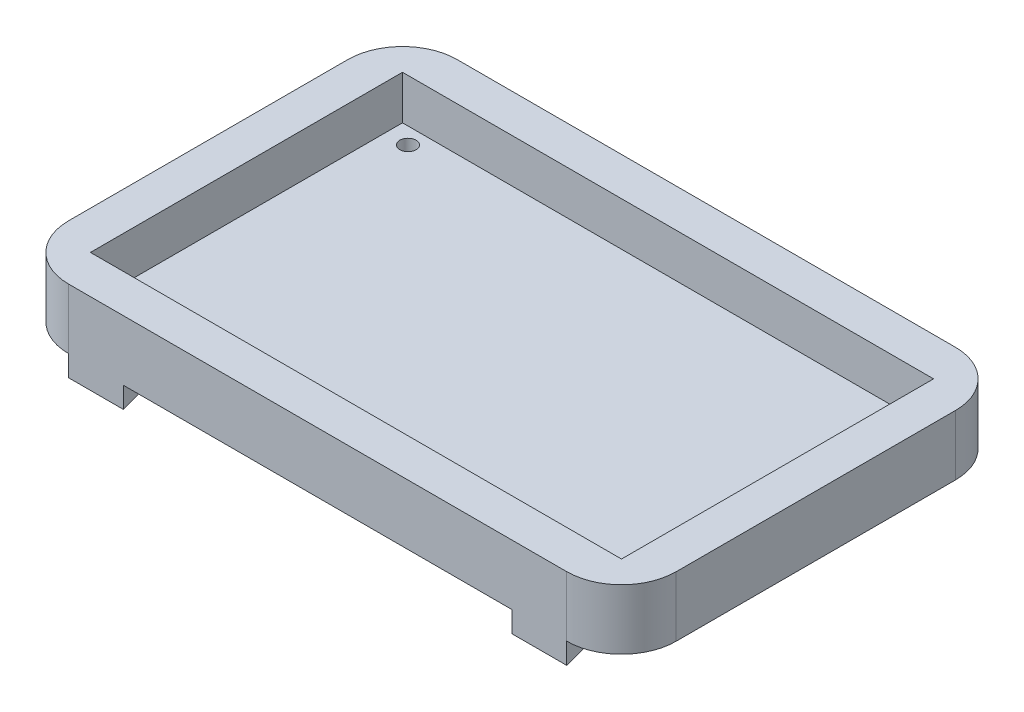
ISO-10303-21;
HEADER;
FILE_DESCRIPTION(('STEP AP214'),'2;1');
FILE_NAME('part.step','',(''),(''),'','','');
FILE_SCHEMA(('AUTOMOTIVE_DESIGN { 1 0 10303 214 1 1 1 1 }'));
ENDSEC;
DATA;
#1=APPLICATION_CONTEXT('core data for automotive mechanical design processes');
#2=APPLICATION_PROTOCOL_DEFINITION('international standard','automotive_design',2000,#1);
#3=PRODUCT_CONTEXT('',#1,'mechanical');
#4=PRODUCT('Part','Part','',(#3));
#5=PRODUCT_RELATED_PRODUCT_CATEGORY('part','',(#4));
#6=PRODUCT_DEFINITION_FORMATION('','',#4);
#7=PRODUCT_DEFINITION_CONTEXT('part definition',#1,'design');
#8=PRODUCT_DEFINITION('design','',#6,#7);
#9=PRODUCT_DEFINITION_SHAPE('','',#8);
#10=(LENGTH_UNIT() NAMED_UNIT(*) SI_UNIT(.MILLI.,.METRE.));
#11=(NAMED_UNIT(*) PLANE_ANGLE_UNIT() SI_UNIT($,.RADIAN.));
#12=(NAMED_UNIT(*) SI_UNIT($,.STERADIAN.) SOLID_ANGLE_UNIT());
#13=UNCERTAINTY_MEASURE_WITH_UNIT(LENGTH_MEASURE(1.E-05),#10,'distance_accuracy_value','');
#14=(GEOMETRIC_REPRESENTATION_CONTEXT(3) GLOBAL_UNCERTAINTY_ASSIGNED_CONTEXT((#13)) GLOBAL_UNIT_ASSIGNED_CONTEXT((#10,
#11,#12)) REPRESENTATION_CONTEXT('',''));
#15=CARTESIAN_POINT('',(0.,0.,0.));
#16=DIRECTION('',(0.,0.,1.));
#17=DIRECTION('',(1.,0.,0.));
#18=AXIS2_PLACEMENT_3D('',#15,#16,#17);
#19=CARTESIAN_POINT('',(0.,0.,0.));
#20=DIRECTION('',(0.,1.,0.));
#21=DIRECTION('',(0.,0.,1.));
#22=AXIS2_PLACEMENT_3D('',#19,#20,#21);
#23=PLANE('',#22);
#24=CARTESIAN_POINT('',(-36.4644970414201,0.,-21.9674556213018));
#25=DIRECTION('',(0.,1.,0.));
#26=DIRECTION('',(0.,0.,1.));
#27=AXIS2_PLACEMENT_3D('',#24,#25,#26);
#28=CIRCLE('',#27,1.5);
#29=CARTESIAN_POINT('',(-36.4644970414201,0.,-20.4674556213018));
#30=VERTEX_POINT('',#29);
#31=EDGE_CURVE('E245',#30,#30,#28,.T.);
#32=ORIENTED_EDGE('',*,*,#31,.T.);
#33=EDGE_LOOP('',(#32));
#34=FACE_BOUND('',#33,.T.);
#35=CARTESIAN_POINT('',(52.5355029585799,0.,28.6833914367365));
#36=DIRECTION('',(0.,1.,0.));
#37=DIRECTION('',(0.,0.,1.));
#38=AXIS2_PLACEMENT_3D('',#35,#36,#37);
#39=CIRCLE('',#38,1.5);
#40=CARTESIAN_POINT('',(52.5355029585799,0.,30.1833914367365));
#41=VERTEX_POINT('',#40);
#42=EDGE_CURVE('E319',#41,#41,#39,.T.);
#43=ORIENTED_EDGE('',*,*,#42,.T.);
#44=EDGE_LOOP('',(#43));
#45=FACE_BOUND('',#44,.T.);
#46=CARTESIAN_POINT('',(52.5355029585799,0.,-21.9674556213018));
#47=DIRECTION('',(0.,1.,0.));
#48=DIRECTION('',(0.,0.,1.));
#49=AXIS2_PLACEMENT_3D('',#46,#47,#48);
#50=CIRCLE('',#49,1.5);
#51=CARTESIAN_POINT('',(52.5355029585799,0.,-20.4674556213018));
#52=VERTEX_POINT('',#51);
#53=EDGE_CURVE('E315',#52,#52,#50,.T.);
#54=ORIENTED_EDGE('',*,*,#53,.T.);
#55=EDGE_LOOP('',(#54));
#56=FACE_BOUND('',#55,.T.);
#57=CARTESIAN_POINT('',(-36.4704738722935,0.,29.0259959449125));
#58=DIRECTION('',(0.,1.,0.));
#59=DIRECTION('',(0.,0.,1.));
#60=AXIS2_PLACEMENT_3D('',#57,#58,#59);
#61=CIRCLE('',#60,1.5);
#62=CARTESIAN_POINT('',(-36.4704738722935,0.,30.5259959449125));
#63=VERTEX_POINT('',#62);
#64=EDGE_CURVE('E231',#63,#63,#61,.T.);
#65=ORIENTED_EDGE('',*,*,#64,.T.);
#66=EDGE_LOOP('',(#65));
#67=FACE_BOUND('',#66,.T.);
#68=DIRECTION('',(0.,0.,1.));
#69=VECTOR('',#68,1.);
#70=CARTESIAN_POINT('',(53.5355029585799,0.,39.0325443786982));
#71=LINE('',#70,#69);
#72=CARTESIAN_POINT('',(53.5355029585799,0.,35.3350230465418));
#73=VERTEX_POINT('',#72);
#74=CARTESIAN_POINT('',(53.5355029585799,0.,39.0325443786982));
#75=VERTEX_POINT('',#74);
#76=EDGE_CURVE('E389',#73,#75,#71,.T.);
#77=ORIENTED_EDGE('',*,*,#76,.F.);
#78=DIRECTION('',(1.,0.,0.));
#79=VECTOR('',#78,1.);
#80=CARTESIAN_POINT('',(53.5355029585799,0.,35.3350230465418));
#81=LINE('',#80,#79);
#82=CARTESIAN_POINT('',(43.5355029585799,0.,35.3350230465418));
#83=VERTEX_POINT('',#82);
#84=EDGE_CURVE('E400',#83,#73,#81,.T.);
#85=ORIENTED_EDGE('',*,*,#84,.F.);
#86=DIRECTION('',(0.,0.,-1.));
#87=VECTOR('',#86,1.);
#88=CARTESIAN_POINT('',(43.5355029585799,0.,39.0325443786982));
#89=LINE('',#88,#87);
#90=CARTESIAN_POINT('',(43.5355029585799,0.,39.0325443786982));
#91=VERTEX_POINT('',#90);
#92=EDGE_CURVE('E394',#91,#83,#89,.T.);
#93=ORIENTED_EDGE('',*,*,#92,.F.);
#94=DIRECTION('',(1.,0.,0.));
#95=VECTOR('',#94,1.);
#96=CARTESIAN_POINT('',(-47.4644970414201,0.,39.0325443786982));
#97=LINE('',#96,#95);
#98=CARTESIAN_POINT('',(-27.4644970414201,0.,39.0325443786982));
#99=VERTEX_POINT('',#98);
#100=EDGE_CURVE('E260',#99,#91,#97,.T.);
#101=ORIENTED_EDGE('',*,*,#100,.F.);
#102=DIRECTION('',(0.,0.,1.));
#103=VECTOR('',#102,1.);
#104=CARTESIAN_POINT('',(-27.4644970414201,0.,39.0325443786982));
#105=LINE('',#104,#103);
#106=CARTESIAN_POINT('',(-27.4644970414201,0.,35.3350230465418));
#107=VERTEX_POINT('',#106);
#108=EDGE_CURVE('E200',#107,#99,#105,.T.);
#109=ORIENTED_EDGE('',*,*,#108,.F.);
#110=DIRECTION('',(1.,0.,0.));
#111=VECTOR('',#110,1.);
#112=CARTESIAN_POINT('',(-37.4644970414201,0.,35.3350230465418));
#113=LINE('',#112,#111);
#114=CARTESIAN_POINT('',(-37.4644970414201,0.,35.3350230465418));
#115=VERTEX_POINT('',#114);
#116=EDGE_CURVE('E207',#115,#107,#113,.T.);
#117=ORIENTED_EDGE('',*,*,#116,.F.);
#118=DIRECTION('',(0.,0.,-1.));
#119=VECTOR('',#118,1.);
#120=CARTESIAN_POINT('',(-37.4644970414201,0.,39.0325443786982));
#121=LINE('',#120,#119);
#122=CARTESIAN_POINT('',(-37.4644970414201,0.,39.0325443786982));
#123=VERTEX_POINT('',#122);
#124=EDGE_CURVE('E385',#123,#115,#121,.T.);
#125=ORIENTED_EDGE('',*,*,#124,.F.);
#126=CARTESIAN_POINT('',(-37.4644970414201,0.,29.0325443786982));
#127=DIRECTION('',(0.,1.,0.));
#128=DIRECTION('',(0.,0.,1.));
#129=AXIS2_PLACEMENT_3D('',#126,#127,#128);
#130=CIRCLE('',#129,10.);
#131=CARTESIAN_POINT('',(-47.4644970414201,0.,29.0325443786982));
#132=VERTEX_POINT('',#131);
#133=EDGE_CURVE('E332',#123,#132,#130,.F.);
#134=ORIENTED_EDGE('',*,*,#133,.T.);
#135=DIRECTION('',(0.,0.,1.));
#136=VECTOR('',#135,1.);
#137=CARTESIAN_POINT('',(-47.4644970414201,0.,-24.9674556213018));
#138=LINE('',#137,#136);
#139=CARTESIAN_POINT('',(-47.4644970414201,0.,-21.9674556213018));
#140=VERTEX_POINT('',#139);
#141=EDGE_CURVE('E276',#140,#132,#138,.T.);
#142=ORIENTED_EDGE('',*,*,#141,.F.);
#143=CARTESIAN_POINT('',(-37.4644970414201,0.,-21.9674556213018));
#144=DIRECTION('',(0.,1.,0.));
#145=DIRECTION('',(0.,0.,1.));
#146=AXIS2_PLACEMENT_3D('',#143,#144,#145);
#147=CIRCLE('',#146,10.);
#148=CARTESIAN_POINT('',(-37.4644970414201,0.,-31.9674556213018));
#149=VERTEX_POINT('',#148);
#150=EDGE_CURVE('E335',#140,#149,#147,.F.);
#151=ORIENTED_EDGE('',*,*,#150,.T.);
#152=DIRECTION('',(-1.,0.,0.));
#153=VECTOR('',#152,1.);
#154=CARTESIAN_POINT('',(-47.4644970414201,0.,-31.9674556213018));
#155=LINE('',#154,#153);
#156=CARTESIAN_POINT('',(53.5355029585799,0.,-31.9674556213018));
#157=VERTEX_POINT('',#156);
#158=EDGE_CURVE('E241',#157,#149,#155,.T.);
#159=ORIENTED_EDGE('',*,*,#158,.F.);
#160=CARTESIAN_POINT('',(53.5355029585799,0.,-21.9674556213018));
#161=DIRECTION('',(0.,1.,0.));
#162=DIRECTION('',(0.,0.,1.));
#163=AXIS2_PLACEMENT_3D('',#160,#161,#162);
#164=CIRCLE('',#163,10.);
#165=CARTESIAN_POINT('',(63.5355029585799,0.,-21.9674556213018));
#166=VERTEX_POINT('',#165);
#167=EDGE_CURVE('E342',#157,#166,#164,.F.);
#168=ORIENTED_EDGE('',*,*,#167,.T.);
#169=DIRECTION('',(0.,0.,-1.));
#170=VECTOR('',#169,1.);
#171=CARTESIAN_POINT('',(63.5355029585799,0.,-31.9674556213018));
#172=LINE('',#171,#170);
#173=CARTESIAN_POINT('',(63.5355029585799,0.,29.0325443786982));
#174=VERTEX_POINT('',#173);
#175=EDGE_CURVE('E237',#174,#166,#172,.T.);
#176=ORIENTED_EDGE('',*,*,#175,.F.);
#177=CARTESIAN_POINT('',(53.5355029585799,0.,29.0325443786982));
#178=DIRECTION('',(0.,1.,0.));
#179=DIRECTION('',(0.,0.,1.));
#180=AXIS2_PLACEMENT_3D('',#177,#178,#179);
#181=CIRCLE('',#180,10.);
#182=EDGE_CURVE('E338',#174,#75,#181,.F.);
#183=ORIENTED_EDGE('',*,*,#182,.T.);
#184=EDGE_LOOP('',(#77,#85,#93,#101,#109,#117,#125,#134,#142,#151,#159,#168,#176,#183));
#185=FACE_BOUND('',#184,.T.);
#186=ADVANCED_FACE('F43',(#34,#45,#56,#67,#185),#23,.F.);
#187=CARTESIAN_POINT('',(0.,3.,0.));
#188=DIRECTION('',(0.,1.,0.));
#189=DIRECTION('',(0.,0.,1.));
#190=AXIS2_PLACEMENT_3D('',#187,#188,#189);
#191=PLANE('',#190);
#192=CARTESIAN_POINT('',(-36.4644970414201,3.,-21.9674556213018));
#193=DIRECTION('',(0.,1.,0.));
#194=DIRECTION('',(0.,0.,1.));
#195=AXIS2_PLACEMENT_3D('',#192,#193,#194);
#196=CIRCLE('',#195,1.5);
#197=CARTESIAN_POINT('',(-36.4644970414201,3.,-20.4674556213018));
#198=VERTEX_POINT('',#197);
#199=EDGE_CURVE('E220',#198,#198,#196,.T.);
#200=ORIENTED_EDGE('',*,*,#199,.F.);
#201=EDGE_LOOP('',(#200));
#202=FACE_BOUND('',#201,.T.);
#203=CARTESIAN_POINT('',(52.5355029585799,3.,28.6833914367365));
#204=DIRECTION('',(0.,1.,0.));
#205=DIRECTION('',(0.,0.,1.));
#206=AXIS2_PLACEMENT_3D('',#203,#204,#205);
#207=CIRCLE('',#206,1.5);
#208=CARTESIAN_POINT('',(52.5355029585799,3.,30.1833914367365));
#209=VERTEX_POINT('',#208);
#210=EDGE_CURVE('E219',#209,#209,#207,.T.);
#211=ORIENTED_EDGE('',*,*,#210,.F.);
#212=EDGE_LOOP('',(#211));
#213=FACE_BOUND('',#212,.T.);
#214=CARTESIAN_POINT('',(52.5355029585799,3.,-21.9674556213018));
#215=DIRECTION('',(0.,1.,0.));
#216=DIRECTION('',(0.,0.,1.));
#217=AXIS2_PLACEMENT_3D('',#214,#215,#216);
#218=CIRCLE('',#217,1.5);
#219=CARTESIAN_POINT('',(52.5355029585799,3.,-20.4674556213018));
#220=VERTEX_POINT('',#219);
#221=EDGE_CURVE('E215',#220,#220,#218,.T.);
#222=ORIENTED_EDGE('',*,*,#221,.F.);
#223=EDGE_LOOP('',(#222));
#224=FACE_BOUND('',#223,.T.);
#225=CARTESIAN_POINT('',(-36.4704738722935,3.,29.0259959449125));
#226=DIRECTION('',(0.,1.,0.));
#227=DIRECTION('',(0.,0.,1.));
#228=AXIS2_PLACEMENT_3D('',#225,#226,#227);
#229=CIRCLE('',#228,1.5);
#230=CARTESIAN_POINT('',(-36.4704738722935,3.,30.5259959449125));
#231=VERTEX_POINT('',#230);
#232=EDGE_CURVE('E224',#231,#231,#229,.T.);
#233=ORIENTED_EDGE('',*,*,#232,.F.);
#234=EDGE_LOOP('',(#233));
#235=FACE_BOUND('',#234,.T.);
#236=DIRECTION('',(0.,0.,1.));
#237=VECTOR('',#236,1.);
#238=CARTESIAN_POINT('',(-40.4644970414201,3.,-24.9674556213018));
#239=LINE('',#238,#237);
#240=CARTESIAN_POINT('',(-40.4644970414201,3.,-24.9674556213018));
#241=VERTEX_POINT('',#240);
#242=CARTESIAN_POINT('',(-40.4644970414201,3.,32.0325443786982));
#243=VERTEX_POINT('',#242);
#244=EDGE_CURVE('E295',#241,#243,#239,.T.);
#245=ORIENTED_EDGE('',*,*,#244,.T.);
#246=DIRECTION('',(1.,0.,0.));
#247=VECTOR('',#246,1.);
#248=CARTESIAN_POINT('',(-40.4644970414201,3.,32.0325443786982));
#249=LINE('',#248,#247);
#250=CARTESIAN_POINT('',(56.5355029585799,3.,32.0325443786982));
#251=VERTEX_POINT('',#250);
#252=EDGE_CURVE('E299',#243,#251,#249,.T.);
#253=ORIENTED_EDGE('',*,*,#252,.T.);
#254=DIRECTION('',(0.,0.,-1.));
#255=VECTOR('',#254,1.);
#256=CARTESIAN_POINT('',(56.5355029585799,3.,-24.9674556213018));
#257=LINE('',#256,#255);
#258=CARTESIAN_POINT('',(56.5355029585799,3.,-24.9674556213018));
#259=VERTEX_POINT('',#258);
#260=EDGE_CURVE('E303',#251,#259,#257,.T.);
#261=ORIENTED_EDGE('',*,*,#260,.T.);
#262=DIRECTION('',(-1.,0.,0.));
#263=VECTOR('',#262,1.);
#264=CARTESIAN_POINT('',(-40.4644970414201,3.,-24.9674556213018));
#265=LINE('',#264,#263);
#266=EDGE_CURVE('E307',#259,#241,#265,.T.);
#267=ORIENTED_EDGE('',*,*,#266,.T.);
#268=EDGE_LOOP('',(#245,#253,#261,#267));
#269=FACE_BOUND('',#268,.T.);
#270=ADVANCED_FACE('F453',(#202,#213,#224,#235,#269),#191,.T.);
#271=CARTESIAN_POINT('',(-40.4644970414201,11.,-24.9674556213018));
#272=DIRECTION('',(-1.,0.,0.));
#273=DIRECTION('',(0.,0.,1.));
#274=AXIS2_PLACEMENT_3D('',#271,#272,#273);
#275=PLANE('',#274);
#276=ORIENTED_EDGE('',*,*,#244,.F.);
#277=DIRECTION('',(0.,-1.,0.));
#278=VECTOR('',#277,1.);
#279=CARTESIAN_POINT('',(-40.4644970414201,11.,-24.9674556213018));
#280=LINE('',#279,#278);
#281=CARTESIAN_POINT('',(-40.4644970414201,11.,-24.9674556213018));
#282=VERTEX_POINT('',#281);
#283=EDGE_CURVE('E292',#282,#241,#280,.T.);
#284=ORIENTED_EDGE('',*,*,#283,.F.);
#285=DIRECTION('',(0.,0.,-1.));
#286=VECTOR('',#285,1.);
#287=CARTESIAN_POINT('',(-40.4644970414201,11.,-24.9674556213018));
#288=LINE('',#287,#286);
#289=CARTESIAN_POINT('',(-40.4644970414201,11.,32.0325443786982));
#290=VERTEX_POINT('',#289);
#291=EDGE_CURVE('E277',#290,#282,#288,.T.);
#292=ORIENTED_EDGE('',*,*,#291,.F.);
#293=DIRECTION('',(0.,-1.,0.));
#294=VECTOR('',#293,1.);
#295=CARTESIAN_POINT('',(-40.4644970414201,11.,32.0325443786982));
#296=LINE('',#295,#294);
#297=EDGE_CURVE('E285',#290,#243,#296,.T.);
#298=ORIENTED_EDGE('',*,*,#297,.T.);
#299=EDGE_LOOP('',(#276,#284,#292,#298));
#300=FACE_BOUND('',#299,.T.);
#301=ADVANCED_FACE('F461',(#300),#275,.F.);
#302=CARTESIAN_POINT('',(-47.4644970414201,11.,-24.9674556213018));
#303=DIRECTION('',(1.,0.,0.));
#304=DIRECTION('',(0.,0.,-1.));
#305=AXIS2_PLACEMENT_3D('',#302,#303,#304);
#306=PLANE('',#305);
#307=DIRECTION('',(0.,0.,1.));
#308=VECTOR('',#307,1.);
#309=CARTESIAN_POINT('',(-47.4644970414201,11.,-24.9674556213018));
#310=LINE('',#309,#308);
#311=CARTESIAN_POINT('',(-47.4644970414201,11.,-21.9674556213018));
#312=VERTEX_POINT('',#311);
#313=CARTESIAN_POINT('',(-47.4644970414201,11.,29.0325443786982));
#314=VERTEX_POINT('',#313);
#315=EDGE_CURVE('E281',#312,#314,#310,.T.);
#316=ORIENTED_EDGE('',*,*,#315,.F.);
#317=DIRECTION('',(0.,-1.,0.));
#318=VECTOR('',#317,1.);
#319=CARTESIAN_POINT('',(-47.4644970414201,11.,-21.9674556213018));
#320=LINE('',#319,#318);
#321=EDGE_CURVE('E11',#312,#140,#320,.T.);
#322=ORIENTED_EDGE('',*,*,#321,.T.);
#323=ORIENTED_EDGE('',*,*,#141,.T.);
#324=DIRECTION('',(0.,-1.,0.));
#325=VECTOR('',#324,1.);
#326=CARTESIAN_POINT('',(-47.4644970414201,11.,29.0325443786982));
#327=LINE('',#326,#325);
#328=EDGE_CURVE('E52',#132,#314,#327,.F.);
#329=ORIENTED_EDGE('',*,*,#328,.T.);
#330=EDGE_LOOP('',(#316,#322,#323,#329));
#331=FACE_BOUND('',#330,.T.);
#332=ADVANCED_FACE('F372',(#331),#306,.F.);
#333=CARTESIAN_POINT('',(0.,11.,0.));
#334=DIRECTION('',(0.,-1.,0.));
#335=DIRECTION('',(0.,0.,-1.));
#336=AXIS2_PLACEMENT_3D('',#333,#334,#335);
#337=PLANE('',#336);
#338=DIRECTION('',(0.,0.,-1.));
#339=VECTOR('',#338,1.);
#340=CARTESIAN_POINT('',(63.5355029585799,11.,-31.9674556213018));
#341=LINE('',#340,#339);
#342=CARTESIAN_POINT('',(63.5355029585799,11.,29.0325443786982));
#343=VERTEX_POINT('',#342);
#344=CARTESIAN_POINT('',(63.5355029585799,11.,-21.9674556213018));
#345=VERTEX_POINT('',#344);
#346=EDGE_CURVE('E236',#343,#345,#341,.T.);
#347=ORIENTED_EDGE('',*,*,#346,.T.);
#348=CARTESIAN_POINT('',(53.5355029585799,11.,-21.9674556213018));
#349=DIRECTION('',(0.,-1.,0.));
#350=DIRECTION('',(0.,0.,-1.));
#351=AXIS2_PLACEMENT_3D('',#348,#349,#350);
#352=CIRCLE('',#351,10.);
#353=CARTESIAN_POINT('',(53.5355029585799,11.,-31.9674556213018));
#354=VERTEX_POINT('',#353);
#355=EDGE_CURVE('E361',#345,#354,#352,.F.);
#356=ORIENTED_EDGE('',*,*,#355,.T.);
#357=DIRECTION('',(-1.,0.,0.));
#358=VECTOR('',#357,1.);
#359=CARTESIAN_POINT('',(-47.4644970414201,11.,-31.9674556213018));
#360=LINE('',#359,#358);
#361=CARTESIAN_POINT('',(-37.4644970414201,11.,-31.9674556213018));
#362=VERTEX_POINT('',#361);
#363=EDGE_CURVE('E250',#354,#362,#360,.T.);
#364=ORIENTED_EDGE('',*,*,#363,.T.);
#365=CARTESIAN_POINT('',(-37.4644970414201,11.,-21.9674556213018));
#366=DIRECTION('',(0.,-1.,0.));
#367=DIRECTION('',(0.,0.,-1.));
#368=AXIS2_PLACEMENT_3D('',#365,#366,#367);
#369=CIRCLE('',#368,10.);
#370=EDGE_CURVE('E355',#362,#312,#369,.F.);
#371=ORIENTED_EDGE('',*,*,#370,.T.);
#372=ORIENTED_EDGE('',*,*,#315,.T.);
#373=CARTESIAN_POINT('',(-37.4644970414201,11.,29.0325443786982));
#374=DIRECTION('',(0.,-1.,0.));
#375=DIRECTION('',(0.,0.,-1.));
#376=AXIS2_PLACEMENT_3D('',#373,#374,#375);
#377=CIRCLE('',#376,10.);
#378=CARTESIAN_POINT('',(-37.4644970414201,11.,39.0325443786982));
#379=VERTEX_POINT('',#378);
#380=EDGE_CURVE('E352',#314,#379,#377,.F.);
#381=ORIENTED_EDGE('',*,*,#380,.T.);
#382=DIRECTION('',(1.,0.,0.));
#383=VECTOR('',#382,1.);
#384=CARTESIAN_POINT('',(-47.4644970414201,11.,39.0325443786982));
#385=LINE('',#384,#383);
#386=CARTESIAN_POINT('',(53.5355029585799,11.,39.0325443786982));
#387=VERTEX_POINT('',#386);
#388=EDGE_CURVE('E261',#379,#387,#385,.T.);
#389=ORIENTED_EDGE('',*,*,#388,.T.);
#390=CARTESIAN_POINT('',(53.5355029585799,11.,29.0325443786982));
#391=DIRECTION('',(0.,-1.,0.));
#392=DIRECTION('',(0.,0.,-1.));
#393=AXIS2_PLACEMENT_3D('',#390,#391,#392);
#394=CIRCLE('',#393,10.);
#395=EDGE_CURVE('E358',#387,#343,#394,.F.);
#396=ORIENTED_EDGE('',*,*,#395,.T.);
#397=EDGE_LOOP('',(#347,#356,#364,#371,#372,#381,#389,#396));
#398=FACE_BOUND('',#397,.T.);
#399=ORIENTED_EDGE('',*,*,#291,.T.);
#400=DIRECTION('',(1.,0.,0.));
#401=VECTOR('',#400,1.);
#402=CARTESIAN_POINT('',(-47.4644970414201,11.,-24.9674556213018));
#403=LINE('',#402,#401);
#404=CARTESIAN_POINT('',(56.5355029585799,11.,-24.9674556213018));
#405=VERTEX_POINT('',#404);
#406=EDGE_CURVE('E246',#282,#405,#403,.T.);
#407=ORIENTED_EDGE('',*,*,#406,.T.);
#408=DIRECTION('',(0.,0.,1.));
#409=VECTOR('',#408,1.);
#410=CARTESIAN_POINT('',(56.5355029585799,11.,-31.9674556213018));
#411=LINE('',#410,#409);
#412=CARTESIAN_POINT('',(56.5355029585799,11.,32.0325443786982));
#413=VERTEX_POINT('',#412);
#414=EDGE_CURVE('E232',#405,#413,#411,.T.);
#415=ORIENTED_EDGE('',*,*,#414,.T.);
#416=DIRECTION('',(-1.,0.,0.));
#417=VECTOR('',#416,1.);
#418=CARTESIAN_POINT('',(-47.4644970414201,11.,32.0325443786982));
#419=LINE('',#418,#417);
#420=EDGE_CURVE('E265',#413,#290,#419,.T.);
#421=ORIENTED_EDGE('',*,*,#420,.T.);
#422=EDGE_LOOP('',(#399,#407,#415,#421));
#423=FACE_BOUND('',#422,.T.);
#424=ADVANCED_FACE('F379',(#398,#423),#337,.F.);
#425=CARTESIAN_POINT('',(-47.4644970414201,11.,39.0325443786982));
#426=DIRECTION('',(0.,0.,-1.));
#427=DIRECTION('',(-1.,0.,0.));
#428=AXIS2_PLACEMENT_3D('',#425,#426,#427);
#429=PLANE('',#428);
#430=DIRECTION('',(0.,1.,0.));
#431=VECTOR('',#430,1.);
#432=CARTESIAN_POINT('',(-37.4644970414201,-5.,39.0325443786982));
#433=LINE('',#432,#431);
#434=CARTESIAN_POINT('',(-37.4644970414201,-3.8279551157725,39.0325443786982));
#435=VERTEX_POINT('',#434);
#436=EDGE_CURVE('E188',#435,#123,#433,.T.);
#437=ORIENTED_EDGE('',*,*,#436,.F.);
#438=DIRECTION('',(-1.,0.,0.));
#439=VECTOR('',#438,1.);
#440=CARTESIAN_POINT('',(71.5355029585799,-3.8279551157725,39.0325443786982));
#441=LINE('',#440,#439);
#442=CARTESIAN_POINT('',(-27.4644970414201,-3.8279551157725,39.0325443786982));
#443=VERTEX_POINT('',#442);
#444=EDGE_CURVE('E173',#443,#435,#441,.T.);
#445=ORIENTED_EDGE('',*,*,#444,.F.);
#446=DIRECTION('',(0.,1.,0.));
#447=VECTOR('',#446,1.);
#448=CARTESIAN_POINT('',(-27.4644970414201,-5.,39.0325443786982));
#449=LINE('',#448,#447);
#450=EDGE_CURVE('E199',#443,#99,#449,.T.);
#451=ORIENTED_EDGE('',*,*,#450,.T.);
#452=ORIENTED_EDGE('',*,*,#100,.T.);
#453=DIRECTION('',(0.,1.,0.));
#454=VECTOR('',#453,1.);
#455=CARTESIAN_POINT('',(43.5355029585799,-5.,39.0325443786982));
#456=LINE('',#455,#454);
#457=CARTESIAN_POINT('',(43.5355029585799,-3.8279551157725,39.0325443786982));
#458=VERTEX_POINT('',#457);
#459=EDGE_CURVE('E410',#458,#91,#456,.T.);
#460=ORIENTED_EDGE('',*,*,#459,.F.);
#461=CARTESIAN_POINT('',(53.5355029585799,-3.8279551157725,39.0325443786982));
#462=VERTEX_POINT('',#461);
#463=EDGE_CURVE('E182',#462,#458,#441,.T.);
#464=ORIENTED_EDGE('',*,*,#463,.F.);
#465=DIRECTION('',(0.,1.,0.));
#466=VECTOR('',#465,1.);
#467=CARTESIAN_POINT('',(53.5355029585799,-5.,39.0325443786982));
#468=LINE('',#467,#466);
#469=EDGE_CURVE('E413',#462,#75,#468,.T.);
#470=ORIENTED_EDGE('',*,*,#469,.T.);
#471=DIRECTION('',(0.,-1.,0.));
#472=VECTOR('',#471,1.);
#473=CARTESIAN_POINT('',(53.5355029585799,11.,39.0325443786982));
#474=LINE('',#473,#472);
#475=EDGE_CURVE('E366',#75,#387,#474,.F.);
#476=ORIENTED_EDGE('',*,*,#475,.T.);
#477=ORIENTED_EDGE('',*,*,#388,.F.);
#478=DIRECTION('',(0.,-1.,0.));
#479=VECTOR('',#478,1.);
#480=CARTESIAN_POINT('',(-37.4644970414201,11.,39.0325443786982));
#481=LINE('',#480,#479);
#482=EDGE_CURVE('E197',#379,#123,#481,.T.);
#483=ORIENTED_EDGE('',*,*,#482,.T.);
#484=EDGE_LOOP('',(#437,#445,#451,#452,#460,#464,#470,#476,#477,#483));
#485=FACE_BOUND('',#484,.T.);
#486=ADVANCED_FACE('F194',(#485),#429,.F.);
#487=CARTESIAN_POINT('',(-47.4644970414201,11.,32.0325443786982));
#488=DIRECTION('',(0.,0.,1.));
#489=DIRECTION('',(1.,0.,0.));
#490=AXIS2_PLACEMENT_3D('',#487,#488,#489);
#491=PLANE('',#490);
#492=ORIENTED_EDGE('',*,*,#252,.F.);
#493=ORIENTED_EDGE('',*,*,#297,.F.);
#494=ORIENTED_EDGE('',*,*,#420,.F.);
#495=DIRECTION('',(0.,-1.,0.));
#496=VECTOR('',#495,1.);
#497=CARTESIAN_POINT('',(56.5355029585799,11.,32.0325443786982));
#498=LINE('',#497,#496);
#499=EDGE_CURVE('E269',#413,#251,#498,.T.);
#500=ORIENTED_EDGE('',*,*,#499,.T.);
#501=EDGE_LOOP('',(#492,#493,#494,#500));
#502=FACE_BOUND('',#501,.T.);
#503=ADVANCED_FACE('F564',(#502),#491,.F.);
#504=CARTESIAN_POINT('',(-47.4644970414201,11.,-24.9674556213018));
#505=DIRECTION('',(0.,0.,-1.));
#506=DIRECTION('',(-1.,0.,0.));
#507=AXIS2_PLACEMENT_3D('',#504,#505,#506);
#508=PLANE('',#507);
#509=ORIENTED_EDGE('',*,*,#406,.F.);
#510=ORIENTED_EDGE('',*,*,#283,.T.);
#511=ORIENTED_EDGE('',*,*,#266,.F.);
#512=DIRECTION('',(0.,-1.,0.));
#513=VECTOR('',#512,1.);
#514=CARTESIAN_POINT('',(56.5355029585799,11.,-24.9674556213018));
#515=LINE('',#514,#513);
#516=EDGE_CURVE('E254',#405,#259,#515,.T.);
#517=ORIENTED_EDGE('',*,*,#516,.F.);
#518=EDGE_LOOP('',(#509,#510,#511,#517));
#519=FACE_BOUND('',#518,.T.);
#520=ADVANCED_FACE('F635',(#519),#508,.F.);
#521=CARTESIAN_POINT('',(-47.4644970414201,11.,-31.9674556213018));
#522=DIRECTION('',(0.,0.,1.));
#523=DIRECTION('',(1.,0.,0.));
#524=AXIS2_PLACEMENT_3D('',#521,#522,#523);
#525=PLANE('',#524);
#526=ORIENTED_EDGE('',*,*,#363,.F.);
#527=DIRECTION('',(0.,-1.,0.));
#528=VECTOR('',#527,1.);
#529=CARTESIAN_POINT('',(53.5355029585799,11.,-31.9674556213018));
#530=LINE('',#529,#528);
#531=EDGE_CURVE('E328',#354,#157,#530,.T.);
#532=ORIENTED_EDGE('',*,*,#531,.T.);
#533=ORIENTED_EDGE('',*,*,#158,.T.);
#534=DIRECTION('',(0.,-1.,0.));
#535=VECTOR('',#534,1.);
#536=CARTESIAN_POINT('',(-37.4644970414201,11.,-31.9674556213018));
#537=LINE('',#536,#535);
#538=EDGE_CURVE('E311',#149,#362,#537,.F.);
#539=ORIENTED_EDGE('',*,*,#538,.T.);
#540=EDGE_LOOP('',(#526,#532,#533,#539));
#541=FACE_BOUND('',#540,.T.);
#542=ADVANCED_FACE('F485',(#541),#525,.F.);
#543=CARTESIAN_POINT('',(56.5355029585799,11.,-31.9674556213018));
#544=DIRECTION('',(1.,0.,0.));
#545=DIRECTION('',(0.,0.,-1.));
#546=AXIS2_PLACEMENT_3D('',#543,#544,#545);
#547=PLANE('',#546);
#548=ORIENTED_EDGE('',*,*,#414,.F.);
#549=ORIENTED_EDGE('',*,*,#516,.T.);
#550=ORIENTED_EDGE('',*,*,#260,.F.);
#551=ORIENTED_EDGE('',*,*,#499,.F.);
#552=EDGE_LOOP('',(#548,#549,#550,#551));
#553=FACE_BOUND('',#552,.T.);
#554=ADVANCED_FACE('F620',(#553),#547,.F.);
#555=CARTESIAN_POINT('',(63.5355029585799,11.,-31.9674556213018));
#556=DIRECTION('',(-1.,0.,0.));
#557=DIRECTION('',(0.,0.,1.));
#558=AXIS2_PLACEMENT_3D('',#555,#556,#557);
#559=PLANE('',#558);
#560=ORIENTED_EDGE('',*,*,#175,.T.);
#561=DIRECTION('',(0.,-1.,0.));
#562=VECTOR('',#561,1.);
#563=CARTESIAN_POINT('',(63.5355029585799,11.,-21.9674556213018));
#564=LINE('',#563,#562);
#565=EDGE_CURVE('E349',#166,#345,#564,.F.);
#566=ORIENTED_EDGE('',*,*,#565,.T.);
#567=ORIENTED_EDGE('',*,*,#346,.F.);
#568=DIRECTION('',(0.,-1.,0.));
#569=VECTOR('',#568,1.);
#570=CARTESIAN_POINT('',(63.5355029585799,11.,29.0325443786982));
#571=LINE('',#570,#569);
#572=EDGE_CURVE('E345',#343,#174,#571,.T.);
#573=ORIENTED_EDGE('',*,*,#572,.T.);
#574=EDGE_LOOP('',(#560,#566,#567,#573));
#575=FACE_BOUND('',#574,.T.);
#576=ADVANCED_FACE('F491',(#575),#559,.F.);
#577=CARTESIAN_POINT('',(-36.4704738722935,-8.,29.0259959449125));
#578=DIRECTION('',(0.,1.,0.));
#579=DIRECTION('',(0.,0.,1.));
#580=AXIS2_PLACEMENT_3D('',#577,#578,#579);
#581=CYLINDRICAL_SURFACE('',#580,1.5);
#582=ORIENTED_EDGE('',*,*,#232,.T.);
#583=EDGE_LOOP('',(#582));
#584=FACE_BOUND('',#583,.T.);
#585=ORIENTED_EDGE('',*,*,#64,.F.);
#586=EDGE_LOOP('',(#585));
#587=FACE_BOUND('',#586,.T.);
#588=ADVANCED_FACE('F605',(#584,#587),#581,.F.);
#589=CARTESIAN_POINT('',(52.5355029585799,-8.,-21.9674556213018));
#590=DIRECTION('',(0.,1.,0.));
#591=DIRECTION('',(0.,0.,1.));
#592=AXIS2_PLACEMENT_3D('',#589,#590,#591);
#593=CYLINDRICAL_SURFACE('',#592,1.5);
#594=ORIENTED_EDGE('',*,*,#221,.T.);
#595=EDGE_LOOP('',(#594));
#596=FACE_BOUND('',#595,.T.);
#597=ORIENTED_EDGE('',*,*,#53,.F.);
#598=EDGE_LOOP('',(#597));
#599=FACE_BOUND('',#598,.T.);
#600=ADVANCED_FACE('F597',(#596,#599),#593,.F.);
#601=CARTESIAN_POINT('',(52.5355029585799,-8.,28.6833914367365));
#602=DIRECTION('',(0.,1.,0.));
#603=DIRECTION('',(0.,0.,1.));
#604=AXIS2_PLACEMENT_3D('',#601,#602,#603);
#605=CYLINDRICAL_SURFACE('',#604,1.5);
#606=ORIENTED_EDGE('',*,*,#210,.T.);
#607=EDGE_LOOP('',(#606));
#608=FACE_BOUND('',#607,.T.);
#609=ORIENTED_EDGE('',*,*,#42,.F.);
#610=EDGE_LOOP('',(#609));
#611=FACE_BOUND('',#610,.T.);
#612=ADVANCED_FACE('F588',(#608,#611),#605,.F.);
#613=CARTESIAN_POINT('',(-36.4644970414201,-8.,-21.9674556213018));
#614=DIRECTION('',(0.,1.,0.));
#615=DIRECTION('',(0.,0.,1.));
#616=AXIS2_PLACEMENT_3D('',#613,#614,#615);
#617=CYLINDRICAL_SURFACE('',#616,1.5);
#618=ORIENTED_EDGE('',*,*,#199,.T.);
#619=EDGE_LOOP('',(#618));
#620=FACE_BOUND('',#619,.T.);
#621=ORIENTED_EDGE('',*,*,#31,.F.);
#622=EDGE_LOOP('',(#621));
#623=FACE_BOUND('',#622,.T.);
#624=ADVANCED_FACE('F471',(#620,#623),#617,.F.);
#625=CARTESIAN_POINT('',(53.5355029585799,11.,-21.9674556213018));
#626=DIRECTION('',(0.,-1.,0.));
#627=DIRECTION('',(0.,0.,-1.));
#628=AXIS2_PLACEMENT_3D('',#625,#626,#627);
#629=CYLINDRICAL_SURFACE('',#628,10.);
#630=ORIENTED_EDGE('',*,*,#355,.F.);
#631=ORIENTED_EDGE('',*,*,#565,.F.);
#632=ORIENTED_EDGE('',*,*,#167,.F.);
#633=ORIENTED_EDGE('',*,*,#531,.F.);
#634=EDGE_LOOP('',(#630,#631,#632,#633));
#635=FACE_BOUND('',#634,.T.);
#636=ADVANCED_FACE('F467',(#635),#629,.T.);
#637=CARTESIAN_POINT('',(53.5355029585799,11.,29.0325443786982));
#638=DIRECTION('',(0.,-1.,0.));
#639=DIRECTION('',(0.,0.,-1.));
#640=AXIS2_PLACEMENT_3D('',#637,#638,#639);
#641=CYLINDRICAL_SURFACE('',#640,10.);
#642=ORIENTED_EDGE('',*,*,#395,.F.);
#643=ORIENTED_EDGE('',*,*,#475,.F.);
#644=ORIENTED_EDGE('',*,*,#182,.F.);
#645=ORIENTED_EDGE('',*,*,#572,.F.);
#646=EDGE_LOOP('',(#642,#643,#644,#645));
#647=FACE_BOUND('',#646,.T.);
#648=ADVANCED_FACE('F470',(#647),#641,.T.);
#649=CARTESIAN_POINT('',(-37.4644970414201,11.,-21.9674556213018));
#650=DIRECTION('',(0.,-1.,0.));
#651=DIRECTION('',(0.,0.,-1.));
#652=AXIS2_PLACEMENT_3D('',#649,#650,#651);
#653=CYLINDRICAL_SURFACE('',#652,10.);
#654=ORIENTED_EDGE('',*,*,#370,.F.);
#655=ORIENTED_EDGE('',*,*,#538,.F.);
#656=ORIENTED_EDGE('',*,*,#150,.F.);
#657=ORIENTED_EDGE('',*,*,#321,.F.);
#658=EDGE_LOOP('',(#654,#655,#656,#657));
#659=FACE_BOUND('',#658,.T.);
#660=ADVANCED_FACE('F473',(#659),#653,.T.);
#661=CARTESIAN_POINT('',(-37.4644970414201,11.,29.0325443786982));
#662=DIRECTION('',(0.,-1.,0.));
#663=DIRECTION('',(0.,0.,-1.));
#664=AXIS2_PLACEMENT_3D('',#661,#662,#663);
#665=CYLINDRICAL_SURFACE('',#664,10.);
#666=ORIENTED_EDGE('',*,*,#380,.F.);
#667=ORIENTED_EDGE('',*,*,#328,.F.);
#668=ORIENTED_EDGE('',*,*,#133,.F.);
#669=ORIENTED_EDGE('',*,*,#482,.F.);
#670=EDGE_LOOP('',(#666,#667,#668,#669));
#671=FACE_BOUND('',#670,.T.);
#672=ADVANCED_FACE('F45',(#671),#665,.T.);
#673=CARTESIAN_POINT('',(-37.4644970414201,-5.,39.0325443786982));
#674=DIRECTION('',(1.,0.,0.));
#675=DIRECTION('',(0.,0.,-1.));
#676=AXIS2_PLACEMENT_3D('',#673,#674,#675);
#677=PLANE('',#676);
#678=DIRECTION('',(0.,1.,0.));
#679=VECTOR('',#678,1.);
#680=CARTESIAN_POINT('',(-37.4644970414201,-5.,35.3350230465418));
#681=LINE('',#680,#679);
#682=CARTESIAN_POINT('',(-37.4644970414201,-2.5,35.3350230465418));
#683=VERTEX_POINT('',#682);
#684=EDGE_CURVE('E190',#683,#115,#681,.T.);
#685=ORIENTED_EDGE('',*,*,#684,.F.);
#686=DIRECTION('',(0.,0.338009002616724,-0.941142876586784));
#687=VECTOR('',#686,1.);
#688=CARTESIAN_POINT('',(-37.4644970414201,-2.5,35.3350230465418));
#689=LINE('',#688,#687);
#690=EDGE_CURVE('E176',#435,#683,#689,.T.);
#691=ORIENTED_EDGE('',*,*,#690,.F.);
#692=ORIENTED_EDGE('',*,*,#436,.T.);
#693=ORIENTED_EDGE('',*,*,#124,.T.);
#694=EDGE_LOOP('',(#685,#691,#692,#693));
#695=FACE_BOUND('',#694,.T.);
#696=ADVANCED_FACE('F186',(#695),#677,.F.);
#697=CARTESIAN_POINT('',(-37.4644970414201,-5.,35.3350230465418));
#698=DIRECTION('',(0.,0.,1.));
#699=DIRECTION('',(1.,0.,0.));
#700=AXIS2_PLACEMENT_3D('',#697,#698,#699);
#701=PLANE('',#700);
#702=DIRECTION('',(0.,1.,0.));
#703=VECTOR('',#702,1.);
#704=CARTESIAN_POINT('',(-27.4644970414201,-5.,35.3350230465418));
#705=LINE('',#704,#703);
#706=CARTESIAN_POINT('',(-27.4644970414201,-2.5,35.3350230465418));
#707=VERTEX_POINT('',#706);
#708=EDGE_CURVE('E204',#707,#107,#705,.T.);
#709=ORIENTED_EDGE('',*,*,#708,.F.);
#710=DIRECTION('',(-1.,0.,0.));
#711=VECTOR('',#710,1.);
#712=CARTESIAN_POINT('',(71.5355029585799,-2.5,35.3350230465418));
#713=LINE('',#712,#711);
#714=EDGE_CURVE('E59',#707,#683,#713,.T.);
#715=ORIENTED_EDGE('',*,*,#714,.T.);
#716=ORIENTED_EDGE('',*,*,#684,.T.);
#717=ORIENTED_EDGE('',*,*,#116,.T.);
#718=EDGE_LOOP('',(#709,#715,#716,#717));
#719=FACE_BOUND('',#718,.T.);
#720=ADVANCED_FACE('F442',(#719),#701,.F.);
#721=CARTESIAN_POINT('',(-27.4644970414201,-5.,39.0325443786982));
#722=DIRECTION('',(-1.,0.,0.));
#723=DIRECTION('',(0.,0.,1.));
#724=AXIS2_PLACEMENT_3D('',#721,#722,#723);
#725=PLANE('',#724);
#726=ORIENTED_EDGE('',*,*,#450,.F.);
#727=DIRECTION('',(0.,0.338009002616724,-0.941142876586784));
#728=VECTOR('',#727,1.);
#729=CARTESIAN_POINT('',(-27.4644970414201,-3.96186134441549,39.4053891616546));
#730=LINE('',#729,#728);
#731=EDGE_CURVE('E177',#443,#707,#730,.T.);
#732=ORIENTED_EDGE('',*,*,#731,.T.);
#733=ORIENTED_EDGE('',*,*,#708,.T.);
#734=ORIENTED_EDGE('',*,*,#108,.T.);
#735=EDGE_LOOP('',(#726,#732,#733,#734));
#736=FACE_BOUND('',#735,.T.);
#737=ADVANCED_FACE('F441',(#736),#725,.F.);
#738=CARTESIAN_POINT('',(53.5355029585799,-5.,39.0325443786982));
#739=DIRECTION('',(-1.,0.,0.));
#740=DIRECTION('',(0.,0.,1.));
#741=AXIS2_PLACEMENT_3D('',#738,#739,#740);
#742=PLANE('',#741);
#743=ORIENTED_EDGE('',*,*,#469,.F.);
#744=DIRECTION('',(0.,0.338009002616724,-0.941142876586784));
#745=VECTOR('',#744,1.);
#746=CARTESIAN_POINT('',(53.5355029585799,-3.96186134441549,39.4053891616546));
#747=LINE('',#746,#745);
#748=CARTESIAN_POINT('',(53.5355029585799,-2.5,35.3350230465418));
#749=VERTEX_POINT('',#748);
#750=EDGE_CURVE('E418',#462,#749,#747,.T.);
#751=ORIENTED_EDGE('',*,*,#750,.T.);
#752=DIRECTION('',(0.,1.,0.));
#753=VECTOR('',#752,1.);
#754=CARTESIAN_POINT('',(53.5355029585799,-5.,35.3350230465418));
#755=LINE('',#754,#753);
#756=EDGE_CURVE('E404',#749,#73,#755,.T.);
#757=ORIENTED_EDGE('',*,*,#756,.T.);
#758=ORIENTED_EDGE('',*,*,#76,.T.);
#759=EDGE_LOOP('',(#743,#751,#757,#758));
#760=FACE_BOUND('',#759,.T.);
#761=ADVANCED_FACE('F449',(#760),#742,.F.);
#762=CARTESIAN_POINT('',(43.5355029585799,-5.,39.0325443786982));
#763=DIRECTION('',(1.,0.,0.));
#764=DIRECTION('',(0.,0.,-1.));
#765=AXIS2_PLACEMENT_3D('',#762,#763,#764);
#766=PLANE('',#765);
#767=DIRECTION('',(0.,1.,0.));
#768=VECTOR('',#767,1.);
#769=CARTESIAN_POINT('',(43.5355029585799,-5.,35.3350230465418));
#770=LINE('',#769,#768);
#771=CARTESIAN_POINT('',(43.5355029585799,-2.5,35.3350230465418));
#772=VERTEX_POINT('',#771);
#773=EDGE_CURVE('E407',#772,#83,#770,.T.);
#774=ORIENTED_EDGE('',*,*,#773,.F.);
#775=DIRECTION('',(0.,-0.338009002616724,0.941142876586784));
#776=VECTOR('',#775,1.);
#777=CARTESIAN_POINT('',(43.5355029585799,-3.96186134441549,39.4053891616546));
#778=LINE('',#777,#776);
#779=EDGE_CURVE('E67',#772,#458,#778,.T.);
#780=ORIENTED_EDGE('',*,*,#779,.T.);
#781=ORIENTED_EDGE('',*,*,#459,.T.);
#782=ORIENTED_EDGE('',*,*,#92,.T.);
#783=EDGE_LOOP('',(#774,#780,#781,#782));
#784=FACE_BOUND('',#783,.T.);
#785=ADVANCED_FACE('F436',(#784),#766,.F.);
#786=CARTESIAN_POINT('',(53.5355029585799,-5.,35.3350230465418));
#787=DIRECTION('',(0.,0.,1.));
#788=DIRECTION('',(1.,0.,0.));
#789=AXIS2_PLACEMENT_3D('',#786,#787,#788);
#790=PLANE('',#789);
#791=ORIENTED_EDGE('',*,*,#756,.F.);
#792=EDGE_CURVE('E423',#749,#772,#713,.T.);
#793=ORIENTED_EDGE('',*,*,#792,.T.);
#794=ORIENTED_EDGE('',*,*,#773,.T.);
#795=ORIENTED_EDGE('',*,*,#84,.T.);
#796=EDGE_LOOP('',(#791,#793,#794,#795));
#797=FACE_BOUND('',#796,.T.);
#798=ADVANCED_FACE('F499',(#797),#790,.F.);
#799=CARTESIAN_POINT('',(71.5355029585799,-2.5,35.3350230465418));
#800=DIRECTION('',(0.,0.941142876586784,0.338009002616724));
#801=DIRECTION('',(0.,-0.338009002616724,0.941142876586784));
#802=AXIS2_PLACEMENT_3D('',#799,#800,#801);
#803=PLANE('',#802);
#804=ORIENTED_EDGE('',*,*,#463,.T.);
#805=ORIENTED_EDGE('',*,*,#779,.F.);
#806=ORIENTED_EDGE('',*,*,#792,.F.);
#807=ORIENTED_EDGE('',*,*,#750,.F.);
#808=EDGE_LOOP('',(#804,#805,#806,#807));
#809=FACE_BOUND('',#808,.T.);
#810=ADVANCED_FACE('F431',(#809),#803,.F.);
#811=ORIENTED_EDGE('',*,*,#444,.T.);
#812=ORIENTED_EDGE('',*,*,#690,.T.);
#813=ORIENTED_EDGE('',*,*,#714,.F.);
#814=ORIENTED_EDGE('',*,*,#731,.F.);
#815=EDGE_LOOP('',(#811,#812,#813,#814));
#816=FACE_BOUND('',#815,.T.);
#817=ADVANCED_FACE('F175',(#816),#803,.F.);
#818=CLOSED_SHELL('',(#186,#270,#301,#332,#424,#486,#503,#520,#542,#554,#576,#588,#600,#612,
#624,#636,#648,#660,#672,#696,#720,#737,#761,#785,#798,#810,#817));
#819=MANIFOLD_SOLID_BREP('B2',#818);
#820=ADVANCED_BREP_SHAPE_REPRESENTATION('',(#18,#819),#14);
#821=SHAPE_DEFINITION_REPRESENTATION(#9,#820);
ENDSEC;
END-ISO-10303-21;
